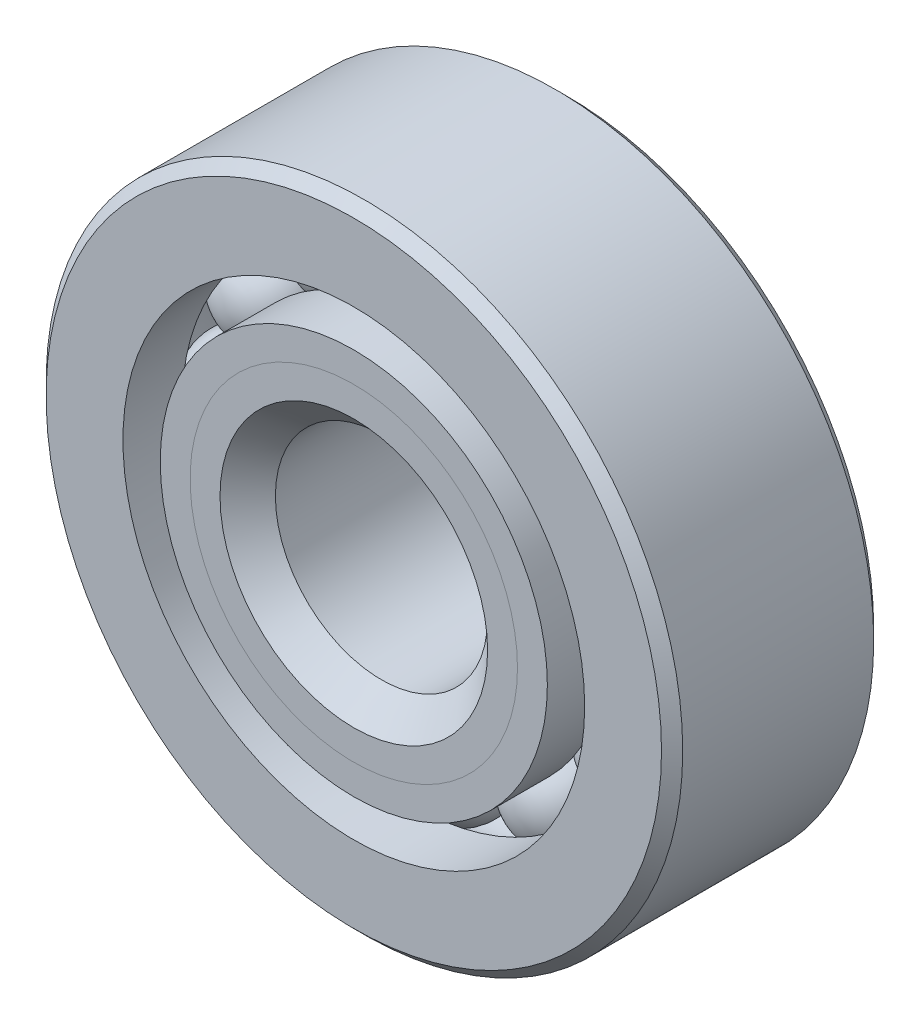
ISO-10303-21;
HEADER;
FILE_DESCRIPTION(('STEP AP214'),'2;1');
FILE_NAME('part.step','',(''),(''),'','','');
FILE_SCHEMA(('AUTOMOTIVE_DESIGN { 1 0 10303 214 1 1 1 1 }'));
ENDSEC;
DATA;
#1=APPLICATION_CONTEXT('core data for automotive mechanical design processes');
#2=APPLICATION_PROTOCOL_DEFINITION('international standard','automotive_design',2000,#1);
#3=PRODUCT_CONTEXT('',#1,'mechanical');
#4=PRODUCT('Part','Part','',(#3));
#5=PRODUCT_RELATED_PRODUCT_CATEGORY('part','',(#4));
#6=PRODUCT_DEFINITION_FORMATION('','',#4);
#7=PRODUCT_DEFINITION_CONTEXT('part definition',#1,'design');
#8=PRODUCT_DEFINITION('design','',#6,#7);
#9=PRODUCT_DEFINITION_SHAPE('','',#8);
#10=(LENGTH_UNIT() NAMED_UNIT(*) SI_UNIT(.MILLI.,.METRE.));
#11=(NAMED_UNIT(*) PLANE_ANGLE_UNIT() SI_UNIT($,.RADIAN.));
#12=(NAMED_UNIT(*) SI_UNIT($,.STERADIAN.) SOLID_ANGLE_UNIT());
#13=UNCERTAINTY_MEASURE_WITH_UNIT(LENGTH_MEASURE(1.E-05),#10,'distance_accuracy_value','');
#14=(GEOMETRIC_REPRESENTATION_CONTEXT(3) GLOBAL_UNCERTAINTY_ASSIGNED_CONTEXT((#13)) GLOBAL_UNIT_ASSIGNED_CONTEXT((#10,
#11,#12)) REPRESENTATION_CONTEXT('',''));
#15=CARTESIAN_POINT('',(0.,0.,0.));
#16=DIRECTION('',(0.,0.,1.));
#17=DIRECTION('',(1.,0.,0.));
#18=AXIS2_PLACEMENT_3D('',#15,#16,#17);
#19=CARTESIAN_POINT('',(-4.76249999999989,8.24889197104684,0.));
#20=DIRECTION('',(0.,0.,1.));
#21=DIRECTION('',(-0.499999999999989,0.866025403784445,0.));
#22=AXIS2_PLACEMENT_3D('',#19,#20,#21);
#23=SPHERICAL_SURFACE('',#22,2.27628073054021);
#24=CARTESIAN_POINT('',(-4.76249999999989,8.24889197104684,2.27628073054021));
#25=VERTEX_POINT('',#24);
#26=VERTEX_LOOP('',#25);
#27=FACE_BOUND('',#26,.T.);
#28=ADVANCED_FACE('F46',(#27),#23,.T.);
#29=CLOSED_SHELL('',(#28));
#30=MANIFOLD_SOLID_BREP('B2',#29);
#31=CARTESIAN_POINT('',(-8.24889197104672,4.7625000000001,0.));
#32=DIRECTION('',(0.,0.,1.));
#33=DIRECTION('',(-0.866025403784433,0.50000000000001,0.));
#34=AXIS2_PLACEMENT_3D('',#31,#32,#33);
#35=SPHERICAL_SURFACE('',#34,2.27628073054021);
#36=CARTESIAN_POINT('',(-8.24889197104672,4.7625000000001,2.27628073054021));
#37=VERTEX_POINT('',#36);
#38=VERTEX_LOOP('',#37);
#39=FACE_BOUND('',#38,.T.);
#40=ADVANCED_FACE('F78',(#39),#35,.T.);
#41=CLOSED_SHELL('',(#40));
#42=MANIFOLD_SOLID_BREP('B6',#41);
#43=CARTESIAN_POINT('',(-9.525,0.,0.));
#44=DIRECTION('',(0.,0.,1.));
#45=DIRECTION('',(-1.,0.,0.));
#46=AXIS2_PLACEMENT_3D('',#43,#44,#45);
#47=SPHERICAL_SURFACE('',#46,2.27628073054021);
#48=CARTESIAN_POINT('',(-9.525,0.,2.27628073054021));
#49=VERTEX_POINT('',#48);
#50=VERTEX_LOOP('',#49);
#51=FACE_BOUND('',#50,.T.);
#52=ADVANCED_FACE('F110',(#51),#47,.T.);
#53=CLOSED_SHELL('',(#52));
#54=MANIFOLD_SOLID_BREP('B42',#53);
#55=CARTESIAN_POINT('',(-8.24889197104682,-4.76249999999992,0.));
#56=DIRECTION('',(0.,0.,1.));
#57=DIRECTION('',(-0.866025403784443,-0.499999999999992,0.));
#58=AXIS2_PLACEMENT_3D('',#55,#56,#57);
#59=SPHERICAL_SURFACE('',#58,2.27628073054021);
#60=CARTESIAN_POINT('',(-8.24889197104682,-4.76249999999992,2.27628073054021));
#61=VERTEX_POINT('',#60);
#62=VERTEX_LOOP('',#61);
#63=FACE_BOUND('',#62,.T.);
#64=ADVANCED_FACE('F142',(#63),#59,.T.);
#65=CLOSED_SHELL('',(#64));
#66=MANIFOLD_SOLID_BREP('B74',#65);
#67=CARTESIAN_POINT('',(-4.76250000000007,-8.24889197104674,0.));
#68=DIRECTION('',(0.,0.,1.));
#69=DIRECTION('',(-0.500000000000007,-0.866025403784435,0.));
#70=AXIS2_PLACEMENT_3D('',#67,#68,#69);
#71=SPHERICAL_SURFACE('',#70,2.27628073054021);
#72=CARTESIAN_POINT('',(-4.76250000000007,-8.24889197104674,2.27628073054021));
#73=VERTEX_POINT('',#72);
#74=VERTEX_LOOP('',#73);
#75=FACE_BOUND('',#74,.T.);
#76=ADVANCED_FACE('F174',(#75),#71,.T.);
#77=CLOSED_SHELL('',(#76));
#78=MANIFOLD_SOLID_BREP('B106',#77);
#79=CARTESIAN_POINT('',(0.,-9.525,0.));
#80=DIRECTION('',(0.,0.,1.));
#81=DIRECTION('',(0.,-1.,0.));
#82=AXIS2_PLACEMENT_3D('',#79,#80,#81);
#83=SPHERICAL_SURFACE('',#82,2.27628073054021);
#84=CARTESIAN_POINT('',(0.,-9.525,2.27628073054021));
#85=VERTEX_POINT('',#84);
#86=VERTEX_LOOP('',#85);
#87=FACE_BOUND('',#86,.T.);
#88=ADVANCED_FACE('F206',(#87),#83,.T.);
#89=CLOSED_SHELL('',(#88));
#90=MANIFOLD_SOLID_BREP('B138',#89);
#91=CARTESIAN_POINT('',(4.76249999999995,-8.2488919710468,0.));
#92=DIRECTION('',(0.,0.,1.));
#93=DIRECTION('',(0.499999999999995,-0.866025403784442,0.));
#94=AXIS2_PLACEMENT_3D('',#91,#92,#93);
#95=SPHERICAL_SURFACE('',#94,2.27628073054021);
#96=CARTESIAN_POINT('',(4.76249999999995,-8.2488919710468,2.27628073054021));
#97=VERTEX_POINT('',#96);
#98=VERTEX_LOOP('',#97);
#99=FACE_BOUND('',#98,.T.);
#100=ADVANCED_FACE('F238',(#99),#95,.T.);
#101=CLOSED_SHELL('',(#100));
#102=MANIFOLD_SOLID_BREP('B170',#101);
#103=CARTESIAN_POINT('',(8.24889197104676,-4.76250000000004,0.));
#104=DIRECTION('',(0.,0.,1.));
#105=DIRECTION('',(0.866025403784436,-0.500000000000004,0.));
#106=AXIS2_PLACEMENT_3D('',#103,#104,#105);
#107=SPHERICAL_SURFACE('',#106,2.27628073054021);
#108=CARTESIAN_POINT('',(8.24889197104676,-4.76250000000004,2.27628073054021));
#109=VERTEX_POINT('',#108);
#110=VERTEX_LOOP('',#109);
#111=FACE_BOUND('',#110,.T.);
#112=ADVANCED_FACE('F270',(#111),#107,.T.);
#113=CLOSED_SHELL('',(#112));
#114=MANIFOLD_SOLID_BREP('B202',#113);
#115=CARTESIAN_POINT('',(9.525,0.,0.));
#116=DIRECTION('',(0.,0.,1.));
#117=DIRECTION('',(1.,0.,0.));
#118=AXIS2_PLACEMENT_3D('',#115,#116,#117);
#119=SPHERICAL_SURFACE('',#118,2.27628073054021);
#120=CARTESIAN_POINT('',(9.525,0.,2.27628073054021));
#121=VERTEX_POINT('',#120);
#122=VERTEX_LOOP('',#121);
#123=FACE_BOUND('',#122,.T.);
#124=ADVANCED_FACE('F302',(#123),#119,.T.);
#125=CLOSED_SHELL('',(#124));
#126=MANIFOLD_SOLID_BREP('B234',#125);
#127=CARTESIAN_POINT('',(8.24889197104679,4.76249999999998,0.));
#128=DIRECTION('',(0.,0.,1.));
#129=DIRECTION('',(0.86602540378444,0.499999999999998,0.));
#130=AXIS2_PLACEMENT_3D('',#127,#128,#129);
#131=SPHERICAL_SURFACE('',#130,2.27628073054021);
#132=CARTESIAN_POINT('',(8.24889197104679,4.76249999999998,2.27628073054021));
#133=VERTEX_POINT('',#132);
#134=VERTEX_LOOP('',#133);
#135=FACE_BOUND('',#134,.T.);
#136=ADVANCED_FACE('F334',(#135),#131,.T.);
#137=CLOSED_SHELL('',(#136));
#138=MANIFOLD_SOLID_BREP('B266',#137);
#139=CARTESIAN_POINT('',(4.76250000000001,8.24889197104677,0.));
#140=DIRECTION('',(0.,0.,1.));
#141=DIRECTION('',(0.500000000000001,0.866025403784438,0.));
#142=AXIS2_PLACEMENT_3D('',#139,#140,#141);
#143=SPHERICAL_SURFACE('',#142,2.27628073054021);
#144=CARTESIAN_POINT('',(4.76250000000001,8.24889197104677,2.27628073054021));
#145=VERTEX_POINT('',#144);
#146=VERTEX_LOOP('',#145);
#147=FACE_BOUND('',#146,.T.);
#148=ADVANCED_FACE('F366',(#147),#143,.T.);
#149=CLOSED_SHELL('',(#148));
#150=MANIFOLD_SOLID_BREP('B298',#149);
#151=CARTESIAN_POINT('',(0.,9.525,0.));
#152=DIRECTION('',(0.,0.,1.));
#153=DIRECTION('',(0.,1.,0.));
#154=AXIS2_PLACEMENT_3D('',#151,#152,#153);
#155=SPHERICAL_SURFACE('',#154,2.27628073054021);
#156=CARTESIAN_POINT('',(0.,9.525,2.27628073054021));
#157=VERTEX_POINT('',#156);
#158=VERTEX_LOOP('',#157);
#159=FACE_BOUND('',#158,.T.);
#160=ADVANCED_FACE('F400',(#159),#155,.T.);
#161=CLOSED_SHELL('',(#160));
#162=MANIFOLD_SOLID_BREP('B330',#161);
#163=CARTESIAN_POINT('',(0.,7.34662349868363,4.7625));
#164=DIRECTION('',(0.,0.,-1.));
#165=DIRECTION('',(-1.,0.,0.));
#166=AXIS2_PLACEMENT_3D('',#163,#164,#165);
#167=PLANE('',#166);
#168=CARTESIAN_POINT('',(0.,0.,4.7625));
#169=DIRECTION('',(0.,0.,1.));
#170=DIRECTION('',(1.,0.,0.));
#171=AXIS2_PLACEMENT_3D('',#168,#169,#170);
#172=CIRCLE('',#171,6.00560963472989);
#173=CARTESIAN_POINT('',(6.00560963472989,0.,4.7625));
#174=VERTEX_POINT('',#173);
#175=EDGE_CURVE('E455',#174,#174,#172,.T.);
#176=ORIENTED_EDGE('',*,*,#175,.F.);
#177=EDGE_LOOP('',(#176));
#178=FACE_BOUND('',#177,.T.);
#179=CARTESIAN_POINT('',(0.,0.,4.7625));
#180=DIRECTION('',(0.,0.,1.));
#181=DIRECTION('',(1.,0.,0.));
#182=AXIS2_PLACEMENT_3D('',#179,#180,#181);
#183=CIRCLE('',#182,7.34662349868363);
#184=CARTESIAN_POINT('',(7.34662349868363,0.,4.7625));
#185=VERTEX_POINT('',#184);
#186=EDGE_CURVE('E399',#185,#185,#183,.T.);
#187=ORIENTED_EDGE('',*,*,#186,.T.);
#188=EDGE_LOOP('',(#187));
#189=FACE_BOUND('',#188,.T.);
#190=ADVANCED_FACE('F421',(#178,#189),#167,.F.);
#191=CARTESIAN_POINT('',(0.,0.,3.42148613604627));
#192=DIRECTION('',(0.,0.,1.));
#193=DIRECTION('',(1.,0.,0.));
#194=AXIS2_PLACEMENT_3D('',#191,#192,#193);
#195=CONICAL_SURFACE('',#194,6.00560963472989,0.78539816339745);
#196=ORIENTED_EDGE('',*,*,#186,.F.);
#197=EDGE_LOOP('',(#196));
#198=FACE_BOUND('',#197,.T.);
#199=CARTESIAN_POINT('',(0.,0.,3.42148613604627));
#200=DIRECTION('',(0.,0.,1.));
#201=DIRECTION('',(1.,0.,0.));
#202=AXIS2_PLACEMENT_3D('',#199,#200,#201);
#203=CIRCLE('',#202,6.00560963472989);
#204=CARTESIAN_POINT('',(6.00560963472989,0.,3.42148613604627));
#205=VERTEX_POINT('',#204);
#206=EDGE_CURVE('E427',#205,#205,#203,.T.);
#207=ORIENTED_EDGE('',*,*,#206,.T.);
#208=EDGE_LOOP('',(#207));
#209=FACE_BOUND('',#208,.T.);
#210=ADVANCED_FACE('F462',(#198,#209),#195,.T.);
#211=CARTESIAN_POINT('',(0.,0.,4.7625));
#212=DIRECTION('',(0.,0.,1.));
#213=DIRECTION('',(1.,0.,0.));
#214=AXIS2_PLACEMENT_3D('',#211,#212,#213);
#215=CYLINDRICAL_SURFACE('',#214,6.00560963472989);
#216=ORIENTED_EDGE('',*,*,#206,.F.);
#217=EDGE_LOOP('',(#216));
#218=FACE_BOUND('',#217,.T.);
#219=CARTESIAN_POINT('',(0.,0.,0.));
#220=DIRECTION('',(0.,0.,1.));
#221=DIRECTION('',(1.,0.,0.));
#222=AXIS2_PLACEMENT_3D('',#219,#220,#221);
#223=CIRCLE('',#222,6.00560963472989);
#224=CARTESIAN_POINT('',(6.00560963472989,0.,0.));
#225=VERTEX_POINT('',#224);
#226=EDGE_CURVE('E431',#225,#225,#223,.T.);
#227=ORIENTED_EDGE('',*,*,#226,.T.);
#228=EDGE_LOOP('',(#227));
#229=FACE_BOUND('',#228,.T.);
#230=ADVANCED_FACE('F466',(#218,#229),#215,.T.);
#231=CARTESIAN_POINT('',(0.,6.00560963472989,0.));
#232=DIRECTION('',(0.,0.,-1.));
#233=DIRECTION('',(-1.,0.,0.));
#234=AXIS2_PLACEMENT_3D('',#231,#232,#233);
#235=PLANE('',#234);
#236=ORIENTED_EDGE('',*,*,#226,.F.);
#237=EDGE_LOOP('',(#236));
#238=FACE_BOUND('',#237,.T.);
#239=CARTESIAN_POINT('',(0.,0.,0.));
#240=DIRECTION('',(0.,0.,1.));
#241=DIRECTION('',(1.,0.,0.));
#242=AXIS2_PLACEMENT_3D('',#239,#240,#241);
#243=CIRCLE('',#242,7.24871926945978);
#244=CARTESIAN_POINT('',(7.24871926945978,0.,0.));
#245=VERTEX_POINT('',#244);
#246=EDGE_CURVE('E435',#245,#245,#243,.T.);
#247=ORIENTED_EDGE('',*,*,#246,.T.);
#248=EDGE_LOOP('',(#247));
#249=FACE_BOUND('',#248,.T.);
#250=ADVANCED_FACE('F471',(#238,#249),#235,.F.);
#251=CARTESIAN_POINT('',(0.,0.,0.));
#252=DIRECTION('',(0.,0.,1.));
#253=DIRECTION('',(1.,0.,0.));
#254=AXIS2_PLACEMENT_3D('',#251,#252,#253);
#255=TOROIDAL_SURFACE('',#254,9.525,2.27628073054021);
#256=ORIENTED_EDGE('',*,*,#246,.F.);
#257=EDGE_LOOP('',(#256));
#258=FACE_BOUND('',#257,.T.);
#259=CARTESIAN_POINT('',(0.,0.,-2.11666666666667));
#260=DIRECTION('',(0.,0.,1.));
#261=DIRECTION('',(1.,0.,0.));
#262=AXIS2_PLACEMENT_3D('',#259,#260,#261);
#263=CIRCLE('',#262,8.68763736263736);
#264=CARTESIAN_POINT('',(8.68763736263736,0.,-2.11666666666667));
#265=VERTEX_POINT('',#264);
#266=EDGE_CURVE('E440',#265,#265,#263,.T.);
#267=ORIENTED_EDGE('',*,*,#266,.T.);
#268=EDGE_LOOP('',(#267));
#269=FACE_BOUND('',#268,.T.);
#270=ADVANCED_FACE('F477',(#258,#269),#255,.F.);
#271=CARTESIAN_POINT('',(0.,0.,4.7625));
#272=DIRECTION('',(0.,0.,1.));
#273=DIRECTION('',(1.,0.,0.));
#274=AXIS2_PLACEMENT_3D('',#271,#272,#273);
#275=CYLINDRICAL_SURFACE('',#274,8.68763736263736);
#276=ORIENTED_EDGE('',*,*,#266,.F.);
#277=EDGE_LOOP('',(#276));
#278=FACE_BOUND('',#277,.T.);
#279=CARTESIAN_POINT('',(0.,0.,-4.76250000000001));
#280=DIRECTION('',(0.,0.,1.));
#281=DIRECTION('',(1.,0.,0.));
#282=AXIS2_PLACEMENT_3D('',#279,#280,#281);
#283=CIRCLE('',#282,8.68763736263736);
#284=CARTESIAN_POINT('',(8.68763736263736,0.,-4.76250000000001));
#285=VERTEX_POINT('',#284);
#286=EDGE_CURVE('E443',#285,#285,#283,.T.);
#287=ORIENTED_EDGE('',*,*,#286,.T.);
#288=EDGE_LOOP('',(#287));
#289=FACE_BOUND('',#288,.T.);
#290=ADVANCED_FACE('F481',(#278,#289),#275,.T.);
#291=CARTESIAN_POINT('',(0.,5.23875,-4.7625));
#292=DIRECTION('',(0.,0.,1.));
#293=DIRECTION('',(1.,0.,0.));
#294=AXIS2_PLACEMENT_3D('',#291,#292,#293);
#295=PLANE('',#294);
#296=ORIENTED_EDGE('',*,*,#286,.F.);
#297=EDGE_LOOP('',(#296));
#298=FACE_BOUND('',#297,.T.);
#299=CARTESIAN_POINT('',(0.,0.,-4.7625));
#300=DIRECTION('',(0.,0.,1.));
#301=DIRECTION('',(1.,0.,0.));
#302=AXIS2_PLACEMENT_3D('',#299,#300,#301);
#303=CIRCLE('',#302,5.23875);
#304=CARTESIAN_POINT('',(5.23875,0.,-4.7625));
#305=VERTEX_POINT('',#304);
#306=EDGE_CURVE('E446',#305,#305,#303,.T.);
#307=ORIENTED_EDGE('',*,*,#306,.T.);
#308=EDGE_LOOP('',(#307));
#309=FACE_BOUND('',#308,.T.);
#310=ADVANCED_FACE('F485',(#298,#309),#295,.F.);
#311=CARTESIAN_POINT('',(0.,0.,-4.28625));
#312=DIRECTION('',(0.,0.,-1.));
#313=DIRECTION('',(-1.,0.,0.));
#314=AXIS2_PLACEMENT_3D('',#311,#312,#313);
#315=CONICAL_SURFACE('',#314,4.7625,0.78539816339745);
#316=ORIENTED_EDGE('',*,*,#306,.F.);
#317=EDGE_LOOP('',(#316));
#318=FACE_BOUND('',#317,.T.);
#319=CARTESIAN_POINT('',(0.,0.,-4.28625));
#320=DIRECTION('',(0.,0.,1.));
#321=DIRECTION('',(1.,0.,0.));
#322=AXIS2_PLACEMENT_3D('',#319,#320,#321);
#323=CIRCLE('',#322,4.7625);
#324=CARTESIAN_POINT('',(4.7625,0.,-4.28625));
#325=VERTEX_POINT('',#324);
#326=EDGE_CURVE('E449',#325,#325,#323,.T.);
#327=ORIENTED_EDGE('',*,*,#326,.T.);
#328=EDGE_LOOP('',(#327));
#329=FACE_BOUND('',#328,.T.);
#330=ADVANCED_FACE('F489',(#318,#329),#315,.F.);
#331=CARTESIAN_POINT('',(0.,0.,4.7625));
#332=DIRECTION('',(0.,0.,1.));
#333=DIRECTION('',(1.,0.,0.));
#334=AXIS2_PLACEMENT_3D('',#331,#332,#333);
#335=CYLINDRICAL_SURFACE('',#334,4.7625);
#336=ORIENTED_EDGE('',*,*,#326,.F.);
#337=EDGE_LOOP('',(#336));
#338=FACE_BOUND('',#337,.T.);
#339=CARTESIAN_POINT('',(0.,0.,3.51939036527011));
#340=DIRECTION('',(0.,0.,1.));
#341=DIRECTION('',(1.,0.,0.));
#342=AXIS2_PLACEMENT_3D('',#339,#340,#341);
#343=CIRCLE('',#342,4.7625);
#344=CARTESIAN_POINT('',(4.7625,0.,3.51939036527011));
#345=VERTEX_POINT('',#344);
#346=EDGE_CURVE('E452',#345,#345,#343,.T.);
#347=ORIENTED_EDGE('',*,*,#346,.T.);
#348=EDGE_LOOP('',(#347));
#349=FACE_BOUND('',#348,.T.);
#350=ADVANCED_FACE('F493',(#338,#349),#335,.F.);
#351=CARTESIAN_POINT('',(0.,0.,4.7625));
#352=DIRECTION('',(0.,0.,1.));
#353=DIRECTION('',(1.,0.,0.));
#354=AXIS2_PLACEMENT_3D('',#351,#352,#353);
#355=CONICAL_SURFACE('',#354,6.00560963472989,0.78539816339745);
#356=ORIENTED_EDGE('',*,*,#346,.F.);
#357=EDGE_LOOP('',(#356));
#358=FACE_BOUND('',#357,.T.);
#359=ORIENTED_EDGE('',*,*,#175,.T.);
#360=EDGE_LOOP('',(#359));
#361=FACE_BOUND('',#360,.T.);
#362=ADVANCED_FACE('F459',(#358,#361),#355,.F.);
#363=CLOSED_SHELL('',(#190,#210,#230,#250,#270,#290,#310,#330,#350,#362));
#364=MANIFOLD_SOLID_BREP('B362',#363);
#365=CARTESIAN_POINT('',(0.,8.68763736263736,4.7625));
#366=DIRECTION('',(0.,0.,-1.));
#367=DIRECTION('',(-1.,0.,0.));
#368=AXIS2_PLACEMENT_3D('',#365,#366,#367);
#369=PLANE('',#368);
#370=CARTESIAN_POINT('',(0.,0.,4.7625));
#371=DIRECTION('',(0.,0.,1.));
#372=DIRECTION('',(1.,0.,0.));
#373=AXIS2_PLACEMENT_3D('',#370,#371,#372);
#374=CIRCLE('',#373,7.34662349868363);
#375=CARTESIAN_POINT('',(7.34662349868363,0.,4.7625));
#376=VERTEX_POINT('',#375);
#377=EDGE_CURVE('E420',#376,#376,#374,.T.);
#378=ORIENTED_EDGE('',*,*,#377,.F.);
#379=EDGE_LOOP('',(#378));
#380=FACE_BOUND('',#379,.T.);
#381=CARTESIAN_POINT('',(0.,0.,4.7625));
#382=DIRECTION('',(0.,0.,1.));
#383=DIRECTION('',(1.,0.,0.));
#384=AXIS2_PLACEMENT_3D('',#381,#382,#383);
#385=CIRCLE('',#384,8.68763736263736);
#386=CARTESIAN_POINT('',(8.68763736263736,0.,4.7625));
#387=VERTEX_POINT('',#386);
#388=EDGE_CURVE('E602',#387,#387,#385,.T.);
#389=ORIENTED_EDGE('',*,*,#388,.T.);
#390=EDGE_LOOP('',(#389));
#391=FACE_BOUND('',#390,.T.);
#392=ADVANCED_FACE('F580',(#380,#391),#369,.F.);
#393=CARTESIAN_POINT('',(0.,0.,4.7625));
#394=DIRECTION('',(0.,0.,1.));
#395=DIRECTION('',(1.,0.,0.));
#396=AXIS2_PLACEMENT_3D('',#393,#394,#395);
#397=CONICAL_SURFACE('',#396,7.34662349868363,0.78539816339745);
#398=CARTESIAN_POINT('',(0.,0.,3.42148613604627));
#399=DIRECTION('',(0.,0.,1.));
#400=DIRECTION('',(1.,0.,0.));
#401=AXIS2_PLACEMENT_3D('',#398,#399,#400);
#402=CIRCLE('',#401,6.00560963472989);
#403=CARTESIAN_POINT('',(6.00560963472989,0.,3.42148613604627));
#404=VERTEX_POINT('',#403);
#405=EDGE_CURVE('E586',#404,#404,#402,.T.);
#406=ORIENTED_EDGE('',*,*,#405,.F.);
#407=EDGE_LOOP('',(#406));
#408=FACE_BOUND('',#407,.T.);
#409=ORIENTED_EDGE('',*,*,#377,.T.);
#410=EDGE_LOOP('',(#409));
#411=FACE_BOUND('',#410,.T.);
#412=ADVANCED_FACE('F627',(#408,#411),#397,.F.);
#413=CARTESIAN_POINT('',(0.,0.,4.7625));
#414=DIRECTION('',(0.,0.,1.));
#415=DIRECTION('',(1.,0.,0.));
#416=AXIS2_PLACEMENT_3D('',#413,#414,#415);
#417=CYLINDRICAL_SURFACE('',#416,6.00560963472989);
#418=CARTESIAN_POINT('',(0.,0.,0.));
#419=DIRECTION('',(0.,0.,1.));
#420=DIRECTION('',(1.,0.,0.));
#421=AXIS2_PLACEMENT_3D('',#418,#419,#420);
#422=CIRCLE('',#421,6.00560963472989);
#423=CARTESIAN_POINT('',(6.00560963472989,0.,0.));
#424=VERTEX_POINT('',#423);
#425=EDGE_CURVE('E590',#424,#424,#422,.T.);
#426=ORIENTED_EDGE('',*,*,#425,.F.);
#427=EDGE_LOOP('',(#426));
#428=FACE_BOUND('',#427,.T.);
#429=ORIENTED_EDGE('',*,*,#405,.T.);
#430=EDGE_LOOP('',(#429));
#431=FACE_BOUND('',#430,.T.);
#432=ADVANCED_FACE('F622',(#428,#431),#417,.F.);
#433=CARTESIAN_POINT('',(0.,6.00560963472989,0.));
#434=DIRECTION('',(0.,0.,1.));
#435=DIRECTION('',(1.,0.,0.));
#436=AXIS2_PLACEMENT_3D('',#433,#434,#435);
#437=PLANE('',#436);
#438=CARTESIAN_POINT('',(0.,0.,0.));
#439=DIRECTION('',(0.,0.,1.));
#440=DIRECTION('',(1.,0.,0.));
#441=AXIS2_PLACEMENT_3D('',#438,#439,#440);
#442=CIRCLE('',#441,7.24871926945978);
#443=CARTESIAN_POINT('',(7.24871926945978,0.,0.));
#444=VERTEX_POINT('',#443);
#445=EDGE_CURVE('E594',#444,#444,#442,.T.);
#446=ORIENTED_EDGE('',*,*,#445,.F.);
#447=EDGE_LOOP('',(#446));
#448=FACE_BOUND('',#447,.T.);
#449=ORIENTED_EDGE('',*,*,#425,.T.);
#450=EDGE_LOOP('',(#449));
#451=FACE_BOUND('',#450,.T.);
#452=ADVANCED_FACE('F616',(#448,#451),#437,.F.);
#453=CARTESIAN_POINT('',(0.,0.,0.));
#454=DIRECTION('',(0.,0.,1.));
#455=DIRECTION('',(1.,0.,0.));
#456=AXIS2_PLACEMENT_3D('',#453,#454,#455);
#457=TOROIDAL_SURFACE('',#456,9.525,2.27628073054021);
#458=CARTESIAN_POINT('',(0.,0.,2.11666666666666));
#459=DIRECTION('',(0.,0.,1.));
#460=DIRECTION('',(1.,0.,0.));
#461=AXIS2_PLACEMENT_3D('',#458,#459,#460);
#462=CIRCLE('',#461,8.68763736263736);
#463=CARTESIAN_POINT('',(8.68763736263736,0.,2.11666666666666));
#464=VERTEX_POINT('',#463);
#465=EDGE_CURVE('E599',#464,#464,#462,.T.);
#466=ORIENTED_EDGE('',*,*,#465,.F.);
#467=EDGE_LOOP('',(#466));
#468=FACE_BOUND('',#467,.T.);
#469=ORIENTED_EDGE('',*,*,#445,.T.);
#470=EDGE_LOOP('',(#469));
#471=FACE_BOUND('',#470,.T.);
#472=ADVANCED_FACE('F610',(#468,#471),#457,.F.);
#473=CARTESIAN_POINT('',(0.,0.,4.7625));
#474=DIRECTION('',(0.,0.,1.));
#475=DIRECTION('',(1.,0.,0.));
#476=AXIS2_PLACEMENT_3D('',#473,#474,#475);
#477=CYLINDRICAL_SURFACE('',#476,8.68763736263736);
#478=ORIENTED_EDGE('',*,*,#388,.F.);
#479=EDGE_LOOP('',(#478));
#480=FACE_BOUND('',#479,.T.);
#481=ORIENTED_EDGE('',*,*,#465,.T.);
#482=EDGE_LOOP('',(#481));
#483=FACE_BOUND('',#482,.T.);
#484=ADVANCED_FACE('F607',(#480,#483),#477,.T.);
#485=CLOSED_SHELL('',(#392,#412,#432,#452,#472,#484));
#486=MANIFOLD_SOLID_BREP('B394',#485);
#487=CARTESIAN_POINT('',(0.,0.,4.28625));
#488=DIRECTION('',(0.,0.,-1.));
#489=DIRECTION('',(-1.,0.,0.));
#490=AXIS2_PLACEMENT_3D('',#487,#488,#489);
#491=CONICAL_SURFACE('',#490,14.2875,0.78539816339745);
#492=CARTESIAN_POINT('',(0.,0.,4.7625));
#493=DIRECTION('',(0.,0.,1.));
#494=DIRECTION('',(1.,0.,0.));
#495=AXIS2_PLACEMENT_3D('',#492,#493,#494);
#496=CIRCLE('',#495,13.81125);
#497=CARTESIAN_POINT('',(13.81125,0.,4.7625));
#498=VERTEX_POINT('',#497);
#499=EDGE_CURVE('E700',#498,#498,#496,.T.);
#500=ORIENTED_EDGE('',*,*,#499,.F.);
#501=EDGE_LOOP('',(#500));
#502=FACE_BOUND('',#501,.T.);
#503=CARTESIAN_POINT('',(0.,0.,4.28625));
#504=DIRECTION('',(0.,0.,1.));
#505=DIRECTION('',(1.,0.,0.));
#506=AXIS2_PLACEMENT_3D('',#503,#504,#505);
#507=CIRCLE('',#506,14.2875);
#508=CARTESIAN_POINT('',(14.2875,0.,4.28625));
#509=VERTEX_POINT('',#508);
#510=EDGE_CURVE('E579',#509,#509,#507,.T.);
#511=ORIENTED_EDGE('',*,*,#510,.T.);
#512=EDGE_LOOP('',(#511));
#513=FACE_BOUND('',#512,.T.);
#514=ADVANCED_FACE('F672',(#502,#513),#491,.T.);
#515=CARTESIAN_POINT('',(0.,0.,4.7625));
#516=DIRECTION('',(0.,0.,1.));
#517=DIRECTION('',(1.,0.,0.));
#518=AXIS2_PLACEMENT_3D('',#515,#516,#517);
#519=CYLINDRICAL_SURFACE('',#518,14.2875);
#520=ORIENTED_EDGE('',*,*,#510,.F.);
#521=EDGE_LOOP('',(#520));
#522=FACE_BOUND('',#521,.T.);
#523=CARTESIAN_POINT('',(0.,0.,-4.28625));
#524=DIRECTION('',(0.,0.,1.));
#525=DIRECTION('',(1.,0.,0.));
#526=AXIS2_PLACEMENT_3D('',#523,#524,#525);
#527=CIRCLE('',#526,14.2875);
#528=CARTESIAN_POINT('',(14.2875,0.,-4.28625));
#529=VERTEX_POINT('',#528);
#530=EDGE_CURVE('E678',#529,#529,#527,.T.);
#531=ORIENTED_EDGE('',*,*,#530,.T.);
#532=EDGE_LOOP('',(#531));
#533=FACE_BOUND('',#532,.T.);
#534=ADVANCED_FACE('F707',(#522,#533),#519,.T.);
#535=CARTESIAN_POINT('',(0.,0.,-4.76250000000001));
#536=DIRECTION('',(0.,0.,1.));
#537=DIRECTION('',(1.,0.,0.));
#538=AXIS2_PLACEMENT_3D('',#535,#536,#537);
#539=CONICAL_SURFACE('',#538,13.81125,0.785398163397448);
#540=ORIENTED_EDGE('',*,*,#530,.F.);
#541=EDGE_LOOP('',(#540));
#542=FACE_BOUND('',#541,.T.);
#543=CARTESIAN_POINT('',(0.,0.,-4.76250000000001));
#544=DIRECTION('',(0.,0.,1.));
#545=DIRECTION('',(1.,0.,0.));
#546=AXIS2_PLACEMENT_3D('',#543,#544,#545);
#547=CIRCLE('',#546,13.81125);
#548=CARTESIAN_POINT('',(13.81125,0.,-4.76250000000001));
#549=VERTEX_POINT('',#548);
#550=EDGE_CURVE('E682',#549,#549,#547,.T.);
#551=ORIENTED_EDGE('',*,*,#550,.T.);
#552=EDGE_LOOP('',(#551));
#553=FACE_BOUND('',#552,.T.);
#554=ADVANCED_FACE('F711',(#542,#553),#539,.T.);
#555=CARTESIAN_POINT('',(0.,13.81125,-4.7625));
#556=DIRECTION('',(0.,0.,1.));
#557=DIRECTION('',(1.,0.,0.));
#558=AXIS2_PLACEMENT_3D('',#555,#556,#557);
#559=PLANE('',#558);
#560=ORIENTED_EDGE('',*,*,#550,.F.);
#561=EDGE_LOOP('',(#560));
#562=FACE_BOUND('',#561,.T.);
#563=CARTESIAN_POINT('',(0.,0.,-4.76250000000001));
#564=DIRECTION('',(0.,0.,1.));
#565=DIRECTION('',(1.,0.,0.));
#566=AXIS2_PLACEMENT_3D('',#563,#564,#565);
#567=CIRCLE('',#566,10.3623626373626);
#568=CARTESIAN_POINT('',(10.3623626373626,0.,-4.76250000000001));
#569=VERTEX_POINT('',#568);
#570=EDGE_CURVE('E686',#569,#569,#567,.T.);
#571=ORIENTED_EDGE('',*,*,#570,.T.);
#572=EDGE_LOOP('',(#571));
#573=FACE_BOUND('',#572,.T.);
#574=ADVANCED_FACE('F716',(#562,#573),#559,.F.);
#575=CARTESIAN_POINT('',(0.,0.,4.7625));
#576=DIRECTION('',(0.,0.,1.));
#577=DIRECTION('',(1.,0.,0.));
#578=AXIS2_PLACEMENT_3D('',#575,#576,#577);
#579=CYLINDRICAL_SURFACE('',#578,10.3623626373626);
#580=ORIENTED_EDGE('',*,*,#570,.F.);
#581=EDGE_LOOP('',(#580));
#582=FACE_BOUND('',#581,.T.);
#583=CARTESIAN_POINT('',(0.,0.,-2.11666666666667));
#584=DIRECTION('',(0.,0.,1.));
#585=DIRECTION('',(1.,0.,0.));
#586=AXIS2_PLACEMENT_3D('',#583,#584,#585);
#587=CIRCLE('',#586,10.3623626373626);
#588=CARTESIAN_POINT('',(10.3623626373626,0.,-2.11666666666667));
#589=VERTEX_POINT('',#588);
#590=EDGE_CURVE('E691',#589,#589,#587,.T.);
#591=ORIENTED_EDGE('',*,*,#590,.T.);
#592=EDGE_LOOP('',(#591));
#593=FACE_BOUND('',#592,.T.);
#594=ADVANCED_FACE('F722',(#582,#593),#579,.F.);
#595=CARTESIAN_POINT('',(0.,0.,0.));
#596=DIRECTION('',(0.,0.,1.));
#597=DIRECTION('',(1.,0.,0.));
#598=AXIS2_PLACEMENT_3D('',#595,#596,#597);
#599=TOROIDAL_SURFACE('',#598,9.525,2.27628073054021);
#600=ORIENTED_EDGE('',*,*,#590,.F.);
#601=EDGE_LOOP('',(#600));
#602=FACE_BOUND('',#601,.T.);
#603=CARTESIAN_POINT('',(0.,0.,2.11666666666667));
#604=DIRECTION('',(0.,0.,1.));
#605=DIRECTION('',(1.,0.,0.));
#606=AXIS2_PLACEMENT_3D('',#603,#604,#605);
#607=CIRCLE('',#606,10.3623626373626);
#608=CARTESIAN_POINT('',(10.3623626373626,0.,2.11666666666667));
#609=VERTEX_POINT('',#608);
#610=EDGE_CURVE('E694',#609,#609,#607,.T.);
#611=ORIENTED_EDGE('',*,*,#610,.T.);
#612=EDGE_LOOP('',(#611));
#613=FACE_BOUND('',#612,.T.);
#614=ADVANCED_FACE('F726',(#602,#613),#599,.F.);
#615=CARTESIAN_POINT('',(0.,0.,4.7625));
#616=DIRECTION('',(0.,0.,1.));
#617=DIRECTION('',(1.,0.,0.));
#618=AXIS2_PLACEMENT_3D('',#615,#616,#617);
#619=CYLINDRICAL_SURFACE('',#618,10.3623626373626);
#620=ORIENTED_EDGE('',*,*,#610,.F.);
#621=EDGE_LOOP('',(#620));
#622=FACE_BOUND('',#621,.T.);
#623=CARTESIAN_POINT('',(0.,0.,4.7625));
#624=DIRECTION('',(0.,0.,1.));
#625=DIRECTION('',(1.,0.,0.));
#626=AXIS2_PLACEMENT_3D('',#623,#624,#625);
#627=CIRCLE('',#626,10.3623626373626);
#628=CARTESIAN_POINT('',(10.3623626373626,0.,4.7625));
#629=VERTEX_POINT('',#628);
#630=EDGE_CURVE('E697',#629,#629,#627,.T.);
#631=ORIENTED_EDGE('',*,*,#630,.T.);
#632=EDGE_LOOP('',(#631));
#633=FACE_BOUND('',#632,.T.);
#634=ADVANCED_FACE('F730',(#622,#633),#619,.F.);
#635=CARTESIAN_POINT('',(0.,13.81125,4.7625));
#636=DIRECTION('',(0.,0.,-1.));
#637=DIRECTION('',(-1.,0.,0.));
#638=AXIS2_PLACEMENT_3D('',#635,#636,#637);
#639=PLANE('',#638);
#640=ORIENTED_EDGE('',*,*,#630,.F.);
#641=EDGE_LOOP('',(#640));
#642=FACE_BOUND('',#641,.T.);
#643=ORIENTED_EDGE('',*,*,#499,.T.);
#644=EDGE_LOOP('',(#643));
#645=FACE_BOUND('',#644,.T.);
#646=ADVANCED_FACE('F704',(#642,#645),#639,.F.);
#647=CLOSED_SHELL('',(#514,#534,#554,#574,#594,#614,#634,#646));
#648=MANIFOLD_SOLID_BREP('B415',#647);
#649=ADVANCED_BREP_SHAPE_REPRESENTATION('',(#18,#30,#42,#54,#66,#78,#90,#102,#114,#126,#138,
#150,#162,#364,#486,#648),#14);
#650=SHAPE_DEFINITION_REPRESENTATION(#9,#649);
ENDSEC;
END-ISO-10303-21;
